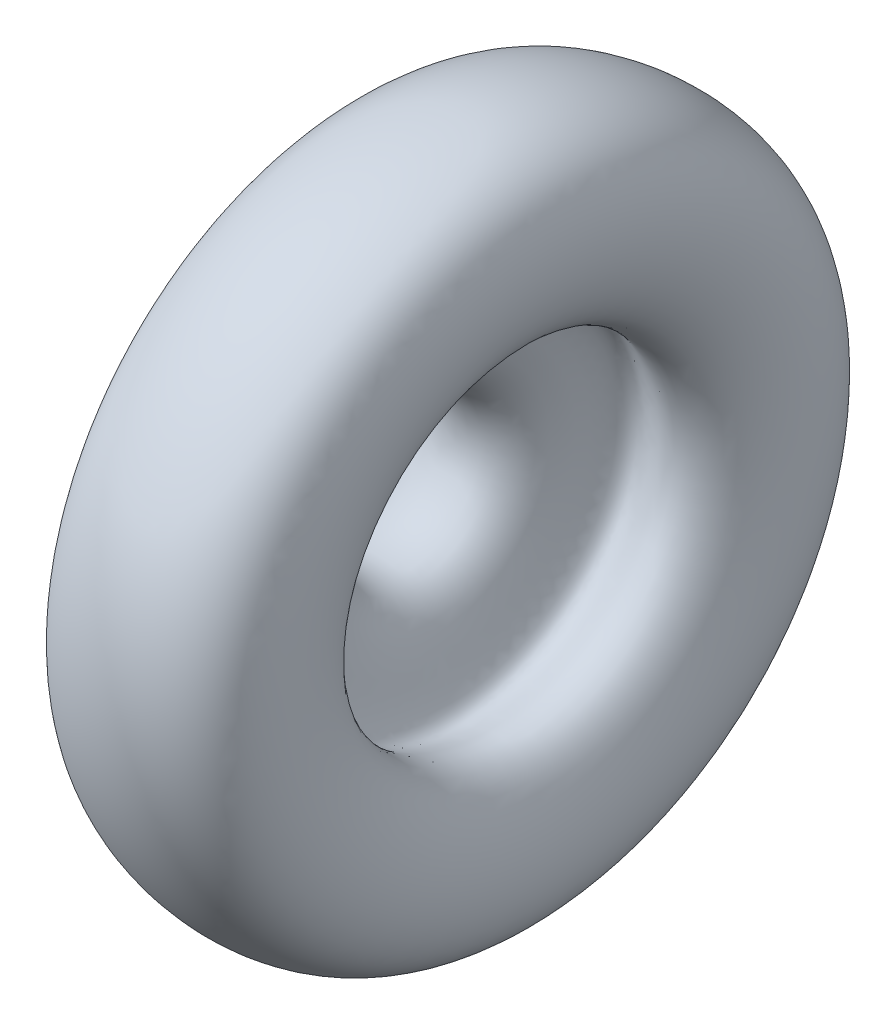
from build123d import *


with BuildPart() as part:
    # Skizze1 → Rotation2 (revolve)
    with BuildSketch(Plane.XY):
        with BuildLine():
            add(Edge.make_bspline(
                [(0, 0), (-2.845083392, 12.210276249), (8.52917375, 46.037207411), (51.68365962, 69.967875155), (108.496461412, 69.42404235), (150.296825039, 22.359836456), (154.884238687, -63.137480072), (259.620446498, -10.453804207), (332.518068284, -300.054721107), (-42.294303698, -223.225447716), (122.187408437, -55.541040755), (6.937596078, -29.774158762), (0, 0)],
                knots=[0, 0, 0, 0, 0.04453098, 0.099235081, 0.157690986, 0.215618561, 0.304275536, 0.340416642, 0.53000556, 0.769119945, 0.891413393, 1, 1, 1, 1], degree=3))
        make_face()
    revolve(axis=Axis((156.636992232, 153.039516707, 0), (-1, 0, 0)))


solid = part.part
